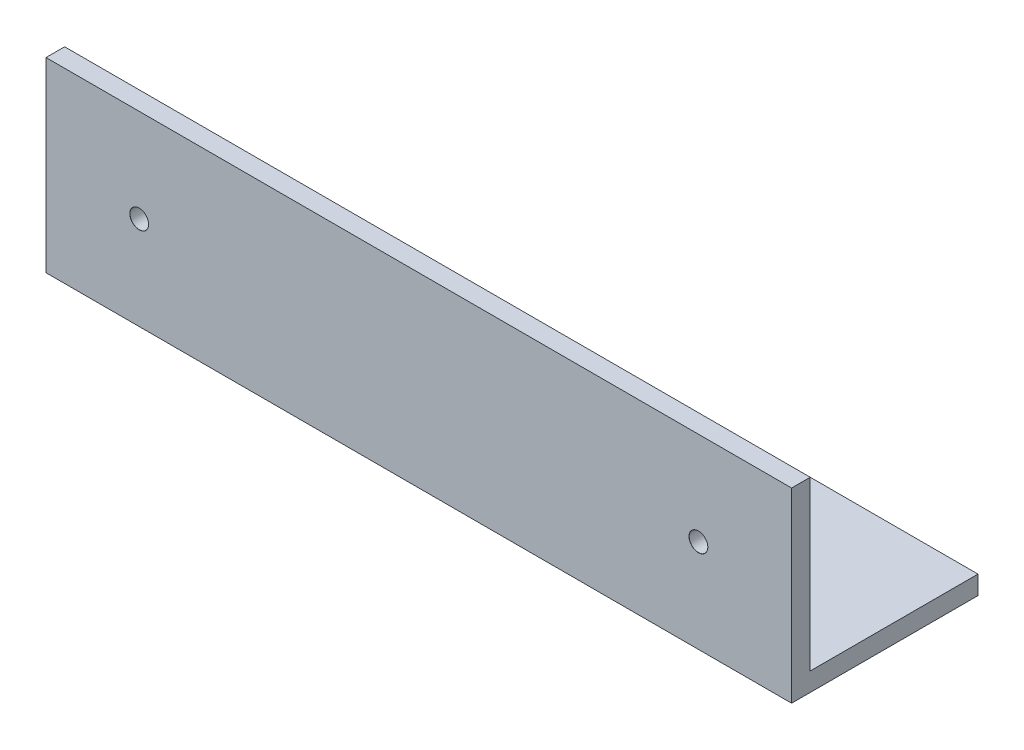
ISO-10303-21;
HEADER;
FILE_DESCRIPTION(('STEP AP214'),'2;1');
FILE_NAME('part.step','',(''),(''),'','','');
FILE_SCHEMA(('AUTOMOTIVE_DESIGN { 1 0 10303 214 1 1 1 1 }'));
ENDSEC;
DATA;
#1=APPLICATION_CONTEXT('core data for automotive mechanical design processes');
#2=APPLICATION_PROTOCOL_DEFINITION('international standard','automotive_design',2000,#1);
#3=PRODUCT_CONTEXT('',#1,'mechanical');
#4=PRODUCT('Part','Part','',(#3));
#5=PRODUCT_RELATED_PRODUCT_CATEGORY('part','',(#4));
#6=PRODUCT_DEFINITION_FORMATION('','',#4);
#7=PRODUCT_DEFINITION_CONTEXT('part definition',#1,'design');
#8=PRODUCT_DEFINITION('design','',#6,#7);
#9=PRODUCT_DEFINITION_SHAPE('','',#8);
#10=(LENGTH_UNIT() NAMED_UNIT(*) SI_UNIT(.MILLI.,.METRE.));
#11=(NAMED_UNIT(*) PLANE_ANGLE_UNIT() SI_UNIT($,.RADIAN.));
#12=(NAMED_UNIT(*) SI_UNIT($,.STERADIAN.) SOLID_ANGLE_UNIT());
#13=UNCERTAINTY_MEASURE_WITH_UNIT(LENGTH_MEASURE(1.E-05),#10,'distance_accuracy_value','');
#14=(GEOMETRIC_REPRESENTATION_CONTEXT(3) GLOBAL_UNCERTAINTY_ASSIGNED_CONTEXT((#13)) GLOBAL_UNIT_ASSIGNED_CONTEXT((#10,
#11,#12)) REPRESENTATION_CONTEXT('',''));
#15=CARTESIAN_POINT('',(0.,0.,0.));
#16=DIRECTION('',(0.,0.,1.));
#17=DIRECTION('',(1.,0.,0.));
#18=AXIS2_PLACEMENT_3D('',#15,#16,#17);
#19=CARTESIAN_POINT('',(100.,0.,0.));
#20=DIRECTION('',(0.,1.,0.));
#21=DIRECTION('',(0.,0.,1.));
#22=AXIS2_PLACEMENT_3D('',#19,#20,#21);
#23=PLANE('',#22);
#24=CARTESIAN_POINT('',(75.,0.,-25.));
#25=DIRECTION('',(0.,1.,0.));
#26=DIRECTION('',(0.,0.,1.));
#27=AXIS2_PLACEMENT_3D('',#24,#25,#26);
#28=CIRCLE('',#27,2.525);
#29=CARTESIAN_POINT('',(75.,0.,-22.475));
#30=VERTEX_POINT('',#29);
#31=EDGE_CURVE('E165',#30,#30,#28,.T.);
#32=ORIENTED_EDGE('',*,*,#31,.T.);
#33=EDGE_LOOP('',(#32));
#34=FACE_BOUND('',#33,.T.);
#35=CARTESIAN_POINT('',(-75.,0.,-25.));
#36=DIRECTION('',(0.,1.,0.));
#37=DIRECTION('',(0.,0.,1.));
#38=AXIS2_PLACEMENT_3D('',#35,#36,#37);
#39=CIRCLE('',#38,2.525);
#40=CARTESIAN_POINT('',(-75.,0.,-22.475));
#41=VERTEX_POINT('',#40);
#42=EDGE_CURVE('E168',#41,#41,#39,.T.);
#43=ORIENTED_EDGE('',*,*,#42,.T.);
#44=EDGE_LOOP('',(#43));
#45=FACE_BOUND('',#44,.T.);
#46=DIRECTION('',(0.,0.,-1.));
#47=VECTOR('',#46,1.);
#48=CARTESIAN_POINT('',(-100.,0.,0.));
#49=LINE('',#48,#47);
#50=CARTESIAN_POINT('',(-100.,0.,0.));
#51=VERTEX_POINT('',#50);
#52=CARTESIAN_POINT('',(-100.,0.,-50.));
#53=VERTEX_POINT('',#52);
#54=EDGE_CURVE('E117',#51,#53,#49,.T.);
#55=ORIENTED_EDGE('',*,*,#54,.T.);
#56=DIRECTION('',(-1.,0.,0.));
#57=VECTOR('',#56,1.);
#58=CARTESIAN_POINT('',(100.,0.,-50.));
#59=LINE('',#58,#57);
#60=CARTESIAN_POINT('',(100.,0.,-50.));
#61=VERTEX_POINT('',#60);
#62=EDGE_CURVE('E11',#61,#53,#59,.T.);
#63=ORIENTED_EDGE('',*,*,#62,.F.);
#64=DIRECTION('',(0.,0.,-1.));
#65=VECTOR('',#64,1.);
#66=CARTESIAN_POINT('',(100.,0.,0.));
#67=LINE('',#66,#65);
#68=CARTESIAN_POINT('',(100.,0.,0.));
#69=VERTEX_POINT('',#68);
#70=EDGE_CURVE('E82',#69,#61,#67,.T.);
#71=ORIENTED_EDGE('',*,*,#70,.F.);
#72=DIRECTION('',(-1.,0.,0.));
#73=VECTOR('',#72,1.);
#74=CARTESIAN_POINT('',(100.,0.,0.));
#75=LINE('',#74,#73);
#76=EDGE_CURVE('E113',#69,#51,#75,.T.);
#77=ORIENTED_EDGE('',*,*,#76,.T.);
#78=EDGE_LOOP('',(#55,#63,#71,#77));
#79=FACE_BOUND('',#78,.T.);
#80=ADVANCED_FACE('F36',(#34,#45,#79),#23,.F.);
#81=CARTESIAN_POINT('',(100.,5.,-50.));
#82=DIRECTION('',(0.,0.,-1.));
#83=DIRECTION('',(-1.,0.,0.));
#84=AXIS2_PLACEMENT_3D('',#81,#82,#83);
#85=PLANE('',#84);
#86=DIRECTION('',(0.,-1.,0.));
#87=VECTOR('',#86,1.);
#88=CARTESIAN_POINT('',(-100.,5.,-50.));
#89=LINE('',#88,#87);
#90=CARTESIAN_POINT('',(-100.,5.,-50.));
#91=VERTEX_POINT('',#90);
#92=EDGE_CURVE('E120',#91,#53,#89,.T.);
#93=ORIENTED_EDGE('',*,*,#92,.F.);
#94=DIRECTION('',(-1.,0.,0.));
#95=VECTOR('',#94,1.);
#96=CARTESIAN_POINT('',(100.,5.,-50.));
#97=LINE('',#96,#95);
#98=CARTESIAN_POINT('',(100.,5.,-50.));
#99=VERTEX_POINT('',#98);
#100=EDGE_CURVE('E44',#99,#91,#97,.T.);
#101=ORIENTED_EDGE('',*,*,#100,.F.);
#102=DIRECTION('',(0.,-1.,0.));
#103=VECTOR('',#102,1.);
#104=CARTESIAN_POINT('',(100.,5.,-50.));
#105=LINE('',#104,#103);
#106=EDGE_CURVE('E200',#99,#61,#105,.T.);
#107=ORIENTED_EDGE('',*,*,#106,.T.);
#108=ORIENTED_EDGE('',*,*,#62,.T.);
#109=EDGE_LOOP('',(#93,#101,#107,#108));
#110=FACE_BOUND('',#109,.T.);
#111=ADVANCED_FACE('F139',(#110),#85,.T.);
#112=CARTESIAN_POINT('',(100.,5.,0.));
#113=DIRECTION('',(0.,1.,0.));
#114=DIRECTION('',(0.,0.,1.));
#115=AXIS2_PLACEMENT_3D('',#112,#113,#114);
#116=PLANE('',#115);
#117=CARTESIAN_POINT('',(75.,5.,-25.));
#118=DIRECTION('',(0.,1.,0.));
#119=DIRECTION('',(0.,0.,1.));
#120=AXIS2_PLACEMENT_3D('',#117,#118,#119);
#121=CIRCLE('',#120,2.49999999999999);
#122=CARTESIAN_POINT('',(75.,5.,-22.5));
#123=VERTEX_POINT('',#122);
#124=EDGE_CURVE('E177',#123,#123,#121,.T.);
#125=ORIENTED_EDGE('',*,*,#124,.F.);
#126=EDGE_LOOP('',(#125));
#127=FACE_BOUND('',#126,.T.);
#128=CARTESIAN_POINT('',(-75.,5.,-25.));
#129=DIRECTION('',(0.,1.,0.));
#130=DIRECTION('',(0.,0.,1.));
#131=AXIS2_PLACEMENT_3D('',#128,#129,#130);
#132=CIRCLE('',#131,2.49999999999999);
#133=CARTESIAN_POINT('',(-75.,5.,-22.5));
#134=VERTEX_POINT('',#133);
#135=EDGE_CURVE('E170',#134,#134,#132,.T.);
#136=ORIENTED_EDGE('',*,*,#135,.F.);
#137=EDGE_LOOP('',(#136));
#138=FACE_BOUND('',#137,.T.);
#139=DIRECTION('',(0.,0.,-1.));
#140=VECTOR('',#139,1.);
#141=CARTESIAN_POINT('',(-100.,5.,0.));
#142=LINE('',#141,#140);
#143=CARTESIAN_POINT('',(-100.,5.,-5.));
#144=VERTEX_POINT('',#143);
#145=EDGE_CURVE('E124',#144,#91,#142,.T.);
#146=ORIENTED_EDGE('',*,*,#145,.F.);
#147=DIRECTION('',(-1.,0.,0.));
#148=VECTOR('',#147,1.);
#149=CARTESIAN_POINT('',(100.,5.,-5.));
#150=LINE('',#149,#148);
#151=CARTESIAN_POINT('',(100.,5.,-5.));
#152=VERTEX_POINT('',#151);
#153=EDGE_CURVE('E103',#152,#144,#150,.T.);
#154=ORIENTED_EDGE('',*,*,#153,.F.);
#155=DIRECTION('',(0.,0.,-1.));
#156=VECTOR('',#155,1.);
#157=CARTESIAN_POINT('',(100.,5.,0.));
#158=LINE('',#157,#156);
#159=EDGE_CURVE('E109',#152,#99,#158,.T.);
#160=ORIENTED_EDGE('',*,*,#159,.T.);
#161=ORIENTED_EDGE('',*,*,#100,.T.);
#162=EDGE_LOOP('',(#146,#154,#160,#161));
#163=FACE_BOUND('',#162,.T.);
#164=ADVANCED_FACE('F136',(#127,#138,#163),#116,.T.);
#165=CARTESIAN_POINT('',(100.,50.,-5.));
#166=DIRECTION('',(0.,0.,-1.));
#167=DIRECTION('',(0.,1.,0.));
#168=AXIS2_PLACEMENT_3D('',#165,#166,#167);
#169=PLANE('',#168);
#170=CARTESIAN_POINT('',(75.,25.,-5.));
#171=DIRECTION('',(0.,0.,-1.));
#172=DIRECTION('',(0.,1.,0.));
#173=AXIS2_PLACEMENT_3D('',#170,#171,#172);
#174=CIRCLE('',#173,2.49999999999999);
#175=CARTESIAN_POINT('',(75.,27.5,-5.));
#176=VERTEX_POINT('',#175);
#177=EDGE_CURVE('E185',#176,#176,#174,.T.);
#178=ORIENTED_EDGE('',*,*,#177,.F.);
#179=EDGE_LOOP('',(#178));
#180=FACE_BOUND('',#179,.T.);
#181=CARTESIAN_POINT('',(-75.,25.,-5.));
#182=DIRECTION('',(0.,0.,-1.));
#183=DIRECTION('',(0.,1.,0.));
#184=AXIS2_PLACEMENT_3D('',#181,#182,#183);
#185=CIRCLE('',#184,2.49999999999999);
#186=CARTESIAN_POINT('',(-75.,27.5,-5.));
#187=VERTEX_POINT('',#186);
#188=EDGE_CURVE('E194',#187,#187,#185,.T.);
#189=ORIENTED_EDGE('',*,*,#188,.F.);
#190=EDGE_LOOP('',(#189));
#191=FACE_BOUND('',#190,.T.);
#192=DIRECTION('',(0.,-1.,0.));
#193=VECTOR('',#192,1.);
#194=CARTESIAN_POINT('',(-100.,50.,-5.));
#195=LINE('',#194,#193);
#196=CARTESIAN_POINT('',(-100.,50.,-5.));
#197=VERTEX_POINT('',#196);
#198=EDGE_CURVE('E98',#197,#144,#195,.T.);
#199=ORIENTED_EDGE('',*,*,#198,.F.);
#200=DIRECTION('',(-1.,0.,0.));
#201=VECTOR('',#200,1.);
#202=CARTESIAN_POINT('',(100.,50.,-5.));
#203=LINE('',#202,#201);
#204=CARTESIAN_POINT('',(100.,50.,-5.));
#205=VERTEX_POINT('',#204);
#206=EDGE_CURVE('E93',#205,#197,#203,.T.);
#207=ORIENTED_EDGE('',*,*,#206,.F.);
#208=DIRECTION('',(0.,-1.,0.));
#209=VECTOR('',#208,1.);
#210=CARTESIAN_POINT('',(100.,50.,-5.));
#211=LINE('',#210,#209);
#212=EDGE_CURVE('E96',#205,#152,#211,.T.);
#213=ORIENTED_EDGE('',*,*,#212,.T.);
#214=ORIENTED_EDGE('',*,*,#153,.T.);
#215=EDGE_LOOP('',(#199,#207,#213,#214));
#216=FACE_BOUND('',#215,.T.);
#217=ADVANCED_FACE('F95',(#180,#191,#216),#169,.T.);
#218=CARTESIAN_POINT('',(100.,50.,0.));
#219=DIRECTION('',(0.,1.,0.));
#220=DIRECTION('',(0.,0.,1.));
#221=AXIS2_PLACEMENT_3D('',#218,#219,#220);
#222=PLANE('',#221);
#223=DIRECTION('',(0.,0.,-1.));
#224=VECTOR('',#223,1.);
#225=CARTESIAN_POINT('',(-100.,50.,0.));
#226=LINE('',#225,#224);
#227=CARTESIAN_POINT('',(-100.,50.,0.));
#228=VERTEX_POINT('',#227);
#229=EDGE_CURVE('E128',#228,#197,#226,.T.);
#230=ORIENTED_EDGE('',*,*,#229,.F.);
#231=DIRECTION('',(-1.,0.,0.));
#232=VECTOR('',#231,1.);
#233=CARTESIAN_POINT('',(100.,50.,0.));
#234=LINE('',#233,#232);
#235=CARTESIAN_POINT('',(100.,50.,0.));
#236=VERTEX_POINT('',#235);
#237=EDGE_CURVE('E73',#236,#228,#234,.T.);
#238=ORIENTED_EDGE('',*,*,#237,.F.);
#239=DIRECTION('',(0.,0.,-1.));
#240=VECTOR('',#239,1.);
#241=CARTESIAN_POINT('',(100.,50.,0.));
#242=LINE('',#241,#240);
#243=EDGE_CURVE('E107',#236,#205,#242,.T.);
#244=ORIENTED_EDGE('',*,*,#243,.T.);
#245=ORIENTED_EDGE('',*,*,#206,.T.);
#246=EDGE_LOOP('',(#230,#238,#244,#245));
#247=FACE_BOUND('',#246,.T.);
#248=ADVANCED_FACE('F111',(#247),#222,.T.);
#249=CARTESIAN_POINT('',(100.,50.,0.));
#250=DIRECTION('',(0.,0.,-1.));
#251=DIRECTION('',(0.,1.,0.));
#252=AXIS2_PLACEMENT_3D('',#249,#250,#251);
#253=PLANE('',#252);
#254=CARTESIAN_POINT('',(75.,25.,0.));
#255=DIRECTION('',(0.,0.,-1.));
#256=DIRECTION('',(0.,1.,0.));
#257=AXIS2_PLACEMENT_3D('',#254,#255,#256);
#258=CIRCLE('',#257,2.525);
#259=CARTESIAN_POINT('',(75.,27.525,0.));
#260=VERTEX_POINT('',#259);
#261=EDGE_CURVE('E183',#260,#260,#258,.T.);
#262=ORIENTED_EDGE('',*,*,#261,.T.);
#263=EDGE_LOOP('',(#262));
#264=FACE_BOUND('',#263,.T.);
#265=CARTESIAN_POINT('',(-75.,25.,0.));
#266=DIRECTION('',(0.,0.,-1.));
#267=DIRECTION('',(0.,1.,0.));
#268=AXIS2_PLACEMENT_3D('',#265,#266,#267);
#269=CIRCLE('',#268,2.525);
#270=CARTESIAN_POINT('',(-75.,27.525,0.));
#271=VERTEX_POINT('',#270);
#272=EDGE_CURVE('E191',#271,#271,#269,.T.);
#273=ORIENTED_EDGE('',*,*,#272,.T.);
#274=EDGE_LOOP('',(#273));
#275=FACE_BOUND('',#274,.T.);
#276=DIRECTION('',(0.,-1.,0.));
#277=VECTOR('',#276,1.);
#278=CARTESIAN_POINT('',(-100.,50.,0.));
#279=LINE('',#278,#277);
#280=EDGE_CURVE('E76',#228,#51,#279,.T.);
#281=ORIENTED_EDGE('',*,*,#280,.T.);
#282=ORIENTED_EDGE('',*,*,#76,.F.);
#283=DIRECTION('',(0.,-1.,0.));
#284=VECTOR('',#283,1.);
#285=CARTESIAN_POINT('',(100.,50.,0.));
#286=LINE('',#285,#284);
#287=EDGE_CURVE('E52',#236,#69,#286,.T.);
#288=ORIENTED_EDGE('',*,*,#287,.F.);
#289=ORIENTED_EDGE('',*,*,#237,.T.);
#290=EDGE_LOOP('',(#281,#282,#288,#289));
#291=FACE_BOUND('',#290,.T.);
#292=ADVANCED_FACE('F144',(#264,#275,#291),#253,.F.);
#293=CARTESIAN_POINT('',(100.,0.,0.));
#294=DIRECTION('',(-1.,0.,0.));
#295=DIRECTION('',(0.,0.,1.));
#296=AXIS2_PLACEMENT_3D('',#293,#294,#295);
#297=PLANE('',#296);
#298=ORIENTED_EDGE('',*,*,#70,.T.);
#299=ORIENTED_EDGE('',*,*,#106,.F.);
#300=ORIENTED_EDGE('',*,*,#159,.F.);
#301=ORIENTED_EDGE('',*,*,#212,.F.);
#302=ORIENTED_EDGE('',*,*,#243,.F.);
#303=ORIENTED_EDGE('',*,*,#287,.T.);
#304=EDGE_LOOP('',(#298,#299,#300,#301,#302,#303));
#305=FACE_BOUND('',#304,.T.);
#306=ADVANCED_FACE('F106',(#305),#297,.F.);
#307=CARTESIAN_POINT('',(-100.,0.,0.));
#308=DIRECTION('',(-1.,0.,0.));
#309=DIRECTION('',(0.,0.,1.));
#310=AXIS2_PLACEMENT_3D('',#307,#308,#309);
#311=PLANE('',#310);
#312=ORIENTED_EDGE('',*,*,#54,.F.);
#313=ORIENTED_EDGE('',*,*,#280,.F.);
#314=ORIENTED_EDGE('',*,*,#229,.T.);
#315=ORIENTED_EDGE('',*,*,#198,.T.);
#316=ORIENTED_EDGE('',*,*,#145,.T.);
#317=ORIENTED_EDGE('',*,*,#92,.T.);
#318=EDGE_LOOP('',(#312,#313,#314,#315,#316,#317));
#319=FACE_BOUND('',#318,.T.);
#320=ADVANCED_FACE('F142',(#319),#311,.T.);
#321=CARTESIAN_POINT('',(-75.,25.,-0.0250000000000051));
#322=DIRECTION('',(0.,0.,1.));
#323=DIRECTION('',(0.,-1.,0.));
#324=AXIS2_PLACEMENT_3D('',#321,#322,#323);
#325=CONICAL_SURFACE('',#324,2.49999999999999,0.785398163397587);
#326=ORIENTED_EDGE('',*,*,#272,.F.);
#327=EDGE_LOOP('',(#326));
#328=FACE_BOUND('',#327,.T.);
#329=CARTESIAN_POINT('',(-75.,25.,-0.0250000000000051));
#330=DIRECTION('',(0.,0.,-1.));
#331=DIRECTION('',(0.,1.,0.));
#332=AXIS2_PLACEMENT_3D('',#329,#330,#331);
#333=CIRCLE('',#332,2.49999999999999);
#334=CARTESIAN_POINT('',(-75.,27.5,-0.0250000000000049));
#335=VERTEX_POINT('',#334);
#336=EDGE_CURVE('E121',#335,#335,#333,.T.);
#337=ORIENTED_EDGE('',*,*,#336,.T.);
#338=EDGE_LOOP('',(#337));
#339=FACE_BOUND('',#338,.T.);
#340=ADVANCED_FACE('F203',(#328,#339),#325,.F.);
#341=CARTESIAN_POINT('',(-75.,25.,-5.));
#342=DIRECTION('',(0.,0.,-1.));
#343=DIRECTION('',(0.,1.,0.));
#344=AXIS2_PLACEMENT_3D('',#341,#342,#343);
#345=CYLINDRICAL_SURFACE('',#344,2.49999999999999);
#346=ORIENTED_EDGE('',*,*,#336,.F.);
#347=EDGE_LOOP('',(#346));
#348=FACE_BOUND('',#347,.T.);
#349=ORIENTED_EDGE('',*,*,#188,.T.);
#350=EDGE_LOOP('',(#349));
#351=FACE_BOUND('',#350,.T.);
#352=ADVANCED_FACE('F205',(#348,#351),#345,.F.);
#353=CARTESIAN_POINT('',(75.,25.,-0.0250000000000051));
#354=DIRECTION('',(0.,0.,1.));
#355=DIRECTION('',(0.,-1.,0.));
#356=AXIS2_PLACEMENT_3D('',#353,#354,#355);
#357=CONICAL_SURFACE('',#356,2.49999999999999,0.785398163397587);
#358=ORIENTED_EDGE('',*,*,#261,.F.);
#359=EDGE_LOOP('',(#358));
#360=FACE_BOUND('',#359,.T.);
#361=CARTESIAN_POINT('',(75.,25.,-0.0250000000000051));
#362=DIRECTION('',(0.,0.,-1.));
#363=DIRECTION('',(0.,1.,0.));
#364=AXIS2_PLACEMENT_3D('',#361,#362,#363);
#365=CIRCLE('',#364,2.49999999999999);
#366=CARTESIAN_POINT('',(75.,27.5,-0.0250000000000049));
#367=VERTEX_POINT('',#366);
#368=EDGE_CURVE('E188',#367,#367,#365,.T.);
#369=ORIENTED_EDGE('',*,*,#368,.T.);
#370=EDGE_LOOP('',(#369));
#371=FACE_BOUND('',#370,.T.);
#372=ADVANCED_FACE('F208',(#360,#371),#357,.F.);
#373=CARTESIAN_POINT('',(75.,25.,-5.));
#374=DIRECTION('',(0.,0.,-1.));
#375=DIRECTION('',(0.,1.,0.));
#376=AXIS2_PLACEMENT_3D('',#373,#374,#375);
#377=CYLINDRICAL_SURFACE('',#376,2.49999999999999);
#378=ORIENTED_EDGE('',*,*,#368,.F.);
#379=EDGE_LOOP('',(#378));
#380=FACE_BOUND('',#379,.T.);
#381=ORIENTED_EDGE('',*,*,#177,.T.);
#382=EDGE_LOOP('',(#381));
#383=FACE_BOUND('',#382,.T.);
#384=ADVANCED_FACE('F222',(#380,#383),#377,.F.);
#385=CARTESIAN_POINT('',(-75.,0.0249999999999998,-25.));
#386=DIRECTION('',(0.,-1.,0.));
#387=DIRECTION('',(0.,0.,-1.));
#388=AXIS2_PLACEMENT_3D('',#385,#386,#387);
#389=CONICAL_SURFACE('',#388,2.49999999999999,0.785398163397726);
#390=ORIENTED_EDGE('',*,*,#42,.F.);
#391=EDGE_LOOP('',(#390));
#392=FACE_BOUND('',#391,.T.);
#393=CARTESIAN_POINT('',(-75.,0.0249999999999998,-25.));
#394=DIRECTION('',(0.,1.,0.));
#395=DIRECTION('',(0.,0.,1.));
#396=AXIS2_PLACEMENT_3D('',#393,#394,#395);
#397=CIRCLE('',#396,2.49999999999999);
#398=CARTESIAN_POINT('',(-75.,0.0249999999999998,-22.5));
#399=VERTEX_POINT('',#398);
#400=EDGE_CURVE('E174',#399,#399,#397,.T.);
#401=ORIENTED_EDGE('',*,*,#400,.T.);
#402=EDGE_LOOP('',(#401));
#403=FACE_BOUND('',#402,.T.);
#404=ADVANCED_FACE('F224',(#392,#403),#389,.F.);
#405=CARTESIAN_POINT('',(-75.,5.,-25.));
#406=DIRECTION('',(0.,1.,0.));
#407=DIRECTION('',(0.,0.,1.));
#408=AXIS2_PLACEMENT_3D('',#405,#406,#407);
#409=CYLINDRICAL_SURFACE('',#408,2.49999999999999);
#410=ORIENTED_EDGE('',*,*,#400,.F.);
#411=EDGE_LOOP('',(#410));
#412=FACE_BOUND('',#411,.T.);
#413=ORIENTED_EDGE('',*,*,#135,.T.);
#414=EDGE_LOOP('',(#413));
#415=FACE_BOUND('',#414,.T.);
#416=ADVANCED_FACE('F231',(#412,#415),#409,.F.);
#417=CARTESIAN_POINT('',(75.,0.0249999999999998,-25.));
#418=DIRECTION('',(0.,-1.,0.));
#419=DIRECTION('',(0.,0.,-1.));
#420=AXIS2_PLACEMENT_3D('',#417,#418,#419);
#421=CONICAL_SURFACE('',#420,2.49999999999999,0.785398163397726);
#422=ORIENTED_EDGE('',*,*,#31,.F.);
#423=EDGE_LOOP('',(#422));
#424=FACE_BOUND('',#423,.T.);
#425=CARTESIAN_POINT('',(75.,0.0249999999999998,-25.));
#426=DIRECTION('',(0.,1.,0.));
#427=DIRECTION('',(0.,0.,1.));
#428=AXIS2_PLACEMENT_3D('',#425,#426,#427);
#429=CIRCLE('',#428,2.49999999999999);
#430=CARTESIAN_POINT('',(75.,0.0249999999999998,-22.5));
#431=VERTEX_POINT('',#430);
#432=EDGE_CURVE('E171',#431,#431,#429,.T.);
#433=ORIENTED_EDGE('',*,*,#432,.T.);
#434=EDGE_LOOP('',(#433));
#435=FACE_BOUND('',#434,.T.);
#436=ADVANCED_FACE('F288',(#424,#435),#421,.F.);
#437=CARTESIAN_POINT('',(75.,5.,-25.));
#438=DIRECTION('',(0.,1.,0.));
#439=DIRECTION('',(0.,0.,1.));
#440=AXIS2_PLACEMENT_3D('',#437,#438,#439);
#441=CYLINDRICAL_SURFACE('',#440,2.49999999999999);
#442=ORIENTED_EDGE('',*,*,#432,.F.);
#443=EDGE_LOOP('',(#442));
#444=FACE_BOUND('',#443,.T.);
#445=ORIENTED_EDGE('',*,*,#124,.T.);
#446=EDGE_LOOP('',(#445));
#447=FACE_BOUND('',#446,.T.);
#448=ADVANCED_FACE('F297',(#444,#447),#441,.F.);
#449=CLOSED_SHELL('',(#80,#111,#164,#217,#248,#292,#306,#320,#340,#352,#372,#384,#404,#416,#436,#448));
#450=MANIFOLD_SOLID_BREP('B2',#449);
#451=ADVANCED_BREP_SHAPE_REPRESENTATION('',(#18,#450),#14);
#452=SHAPE_DEFINITION_REPRESENTATION(#9,#451);
ENDSEC;
END-ISO-10303-21;
